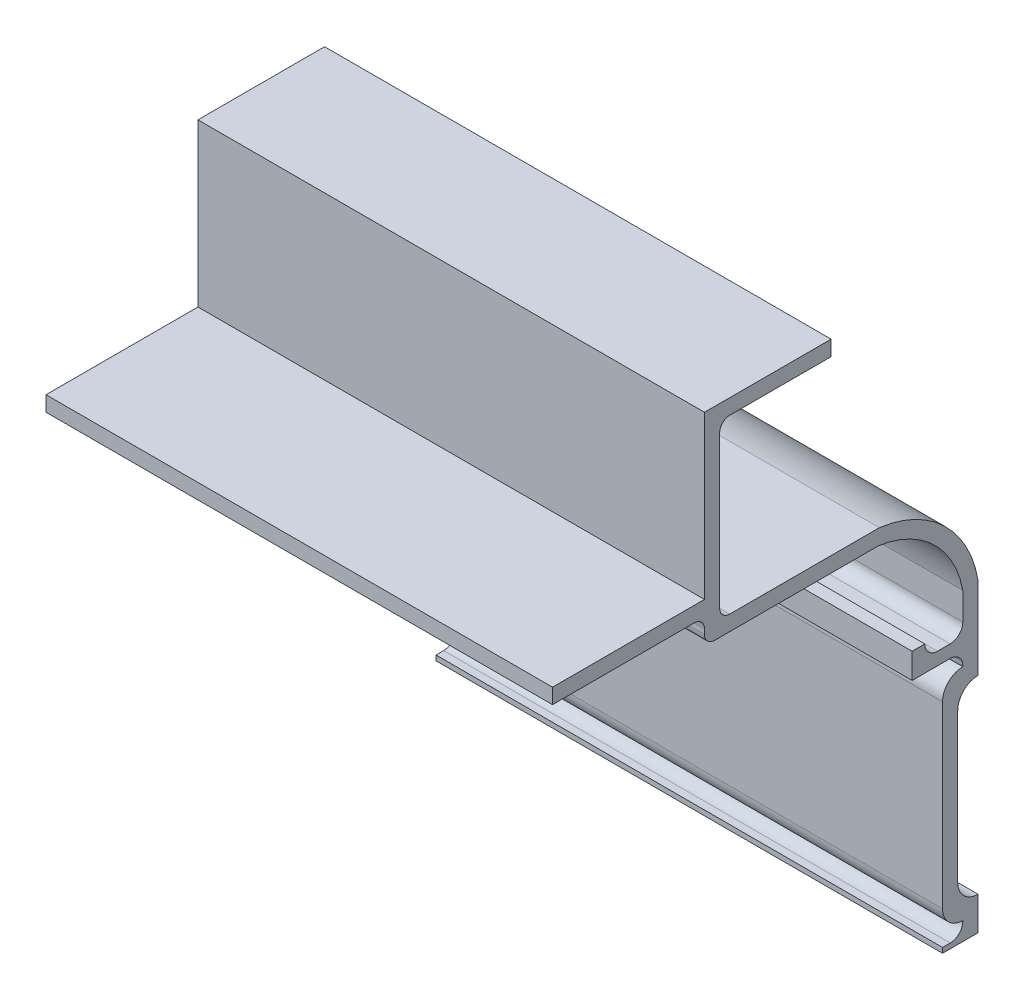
from build123d import *

# Parameters (mm, degrees)
EXTRUDE1_DEPTH = 50


with BuildPart() as part:
    # Sketch1 → Extrude1 (new, symmetric)
    with BuildSketch(Plane(origin=(0, 0, 0), x_dir=(0, 0, -1), z_dir=(1, 0, 0))):
        with BuildLine():
            Line((203.870630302, 163.045870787), (203.870630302, 152.760397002))
            Line((203.870630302, 152.760397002), (203.870630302, 146.760397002))
            ThreePointArc((203.870630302, 146.760397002), (201.042203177, 145.588824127), (199.870630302, 142.760397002))
            Line((199.870630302, 142.760397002), (199.870630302, 113.362042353))
            ThreePointArc((199.870630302, 113.362042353), (201.042203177, 110.533615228), (203.870630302, 109.362042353))
            Line((203.870630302, 109.362042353), (203.870630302, 102.760397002))
            Line((203.870630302, 102.760397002), (196.870630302, 102.760397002))
            Line((196.870630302, 102.760397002), (196.870630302, 103.760397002))
            Line((196.870630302, 103.760397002), (198.370630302, 103.760397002))
            ThreePointArc((198.370630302, 103.760397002), (200.173976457, 104.528940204), (200.86856307, 106.362042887))
            ThreePointArc((200.86856307, 106.362042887), (198.041472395, 107.534346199), (196.870630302, 110.362042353))
            Line((196.870630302, 110.362042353), (196.870630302, 122.382857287))
            Line((196.870630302, 122.382857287), (196.870630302, 145.760397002))
            ThreePointArc((196.870630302, 145.760397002), (198.042203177, 148.588824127), (200.870630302, 149.760397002))
            Line((200.870630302, 149.760397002), (200.870630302, 149.905291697))
            ThreePointArc((200.870630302, 149.905291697), (200.138397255, 151.67305865), (198.370630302, 152.405291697))
            Line((198.370630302, 152.405291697), (190.870630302, 152.405291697))
            Line((190.870630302, 152.405291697), (190.870630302, 157.405291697))
            Line((190.870630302, 157.405291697), (193.370630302, 157.405291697))
            ThreePointArc((193.370630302, 157.405291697), (194.102863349, 155.637524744), (195.870630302, 154.905291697))
            Line((195.870630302, 154.905291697), (198.370630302, 154.905291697))
            ThreePointArc((198.370630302, 154.905291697), (200.138397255, 155.637524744), (200.870630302, 157.405291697))
            Line((200.870630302, 157.405291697), (200.870630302, 162.78720481))
            ThreePointArc((200.870630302, 162.78720481), (195.129999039, 173.482951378), (184.198283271, 178.760397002))
            Line((184.198283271, 178.760397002), (151.870630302, 178.760397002))
            ThreePointArc((151.870630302, 178.760397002), (150.456416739, 179.34618344), (149.870630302, 180.760397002))
            Line((149.870630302, 180.760397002), (149.870630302, 181.760397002))
            ThreePointArc((149.870630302, 181.760397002), (149.284843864, 183.174610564), (147.870630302, 183.760397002))
            Line((147.870630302, 183.760397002), (119.870630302, 183.760397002))
            Line((119.870630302, 183.760397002), (119.870630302, 186.760397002))
            Line((119.870630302, 186.760397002), (149.870630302, 186.760397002))
            Line((149.870630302, 186.760397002), (149.870630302, 218.760397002))
            Line((149.870630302, 218.760397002), (174.870630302, 218.760397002))
            Line((174.870630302, 218.760397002), (174.870630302, 215.760397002))
            Line((174.870630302, 215.760397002), (154.870630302, 215.760397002))
            ThreePointArc((154.870630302, 215.760397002), (153.456416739, 215.174610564), (152.870630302, 213.760397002))
            Line((152.870630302, 213.760397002), (152.870630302, 183.760397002))
            ThreePointArc((152.870630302, 183.760397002), (153.456416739, 182.34618344), (154.870630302, 181.760397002))
            Line((154.870630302, 181.760397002), (184.394645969, 181.760397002))
            ThreePointArc((184.394645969, 181.760397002), (197.22954665, 175.626049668), (203.870630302, 163.045870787))
        make_face()
    extrude(amount=EXTRUDE1_DEPTH, both=True)


solid = part.part
